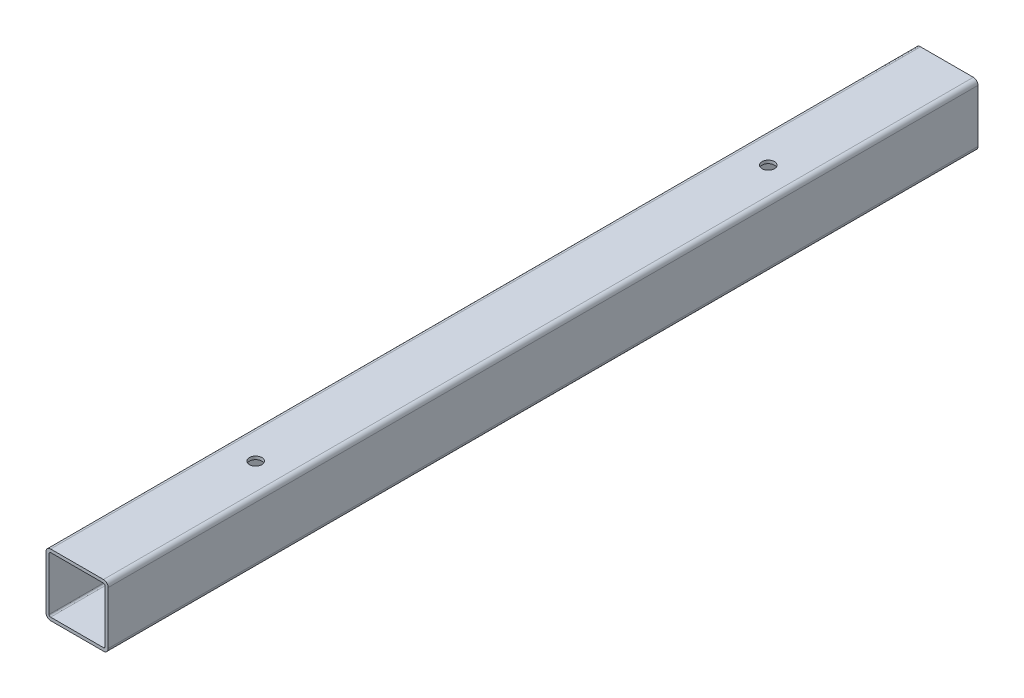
ISO-10303-21;
HEADER;
FILE_DESCRIPTION(('STEP AP214'),'2;1');
FILE_NAME('part.step','',(''),(''),'','','');
FILE_SCHEMA(('AUTOMOTIVE_DESIGN { 1 0 10303 214 1 1 1 1 }'));
ENDSEC;
DATA;
#1=APPLICATION_CONTEXT('core data for automotive mechanical design processes');
#2=APPLICATION_PROTOCOL_DEFINITION('international standard','automotive_design',2000,#1);
#3=PRODUCT_CONTEXT('',#1,'mechanical');
#4=PRODUCT('Part','Part','',(#3));
#5=PRODUCT_RELATED_PRODUCT_CATEGORY('part','',(#4));
#6=PRODUCT_DEFINITION_FORMATION('','',#4);
#7=PRODUCT_DEFINITION_CONTEXT('part definition',#1,'design');
#8=PRODUCT_DEFINITION('design','',#6,#7);
#9=PRODUCT_DEFINITION_SHAPE('','',#8);
#10=(LENGTH_UNIT() NAMED_UNIT(*) SI_UNIT(.MILLI.,.METRE.));
#11=(NAMED_UNIT(*) PLANE_ANGLE_UNIT() SI_UNIT($,.RADIAN.));
#12=(NAMED_UNIT(*) SI_UNIT($,.STERADIAN.) SOLID_ANGLE_UNIT());
#13=UNCERTAINTY_MEASURE_WITH_UNIT(LENGTH_MEASURE(1.E-05),#10,'distance_accuracy_value','');
#14=(GEOMETRIC_REPRESENTATION_CONTEXT(3) GLOBAL_UNCERTAINTY_ASSIGNED_CONTEXT((#13)) GLOBAL_UNIT_ASSIGNED_CONTEXT((#10,
#11,#12)) REPRESENTATION_CONTEXT('',''));
#15=CARTESIAN_POINT('',(0.,0.,0.));
#16=DIRECTION('',(0.,0.,1.));
#17=DIRECTION('',(1.,0.,0.));
#18=AXIS2_PLACEMENT_3D('',#15,#16,#17);
#19=CARTESIAN_POINT('',(3.,37.,560.));
#20=DIRECTION('',(0.,0.,1.));
#21=DIRECTION('',(1.,0.,0.));
#22=AXIS2_PLACEMENT_3D('',#19,#20,#21);
#23=PLANE('',#22);
#24=CARTESIAN_POINT('',(3.,37.,560.));
#25=DIRECTION('',(0.,0.,1.));
#26=DIRECTION('',(1.,0.,0.));
#27=AXIS2_PLACEMENT_3D('',#24,#25,#26);
#28=CIRCLE('',#27,3.);
#29=CARTESIAN_POINT('',(3.00000000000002,40.,560.));
#30=VERTEX_POINT('',#29);
#31=CARTESIAN_POINT('',(0.,37.,560.));
#32=VERTEX_POINT('',#31);
#33=EDGE_CURVE('E224',#30,#32,#28,.T.);
#34=ORIENTED_EDGE('',*,*,#33,.T.);
#35=DIRECTION('',(0.,-1.,0.));
#36=VECTOR('',#35,1.);
#37=CARTESIAN_POINT('',(0.,3.00000000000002,560.));
#38=LINE('',#37,#36);
#39=CARTESIAN_POINT('',(0.,3.00000000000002,560.));
#40=VERTEX_POINT('',#39);
#41=EDGE_CURVE('E227',#32,#40,#38,.T.);
#42=ORIENTED_EDGE('',*,*,#41,.T.);
#43=CARTESIAN_POINT('',(3.,3.,560.));
#44=DIRECTION('',(0.,0.,1.));
#45=DIRECTION('',(1.,0.,0.));
#46=AXIS2_PLACEMENT_3D('',#43,#44,#45);
#47=CIRCLE('',#46,3.);
#48=CARTESIAN_POINT('',(3.00000000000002,0.,560.));
#49=VERTEX_POINT('',#48);
#50=EDGE_CURVE('E229',#40,#49,#47,.T.);
#51=ORIENTED_EDGE('',*,*,#50,.T.);
#52=DIRECTION('',(1.,0.,0.));
#53=VECTOR('',#52,1.);
#54=CARTESIAN_POINT('',(3.00000000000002,0.,560.));
#55=LINE('',#54,#53);
#56=CARTESIAN_POINT('',(37.,0.,560.));
#57=VERTEX_POINT('',#56);
#58=EDGE_CURVE('E231',#49,#57,#55,.T.);
#59=ORIENTED_EDGE('',*,*,#58,.T.);
#60=CARTESIAN_POINT('',(37.,3.,560.));
#61=DIRECTION('',(0.,0.,1.));
#62=DIRECTION('',(1.,0.,0.));
#63=AXIS2_PLACEMENT_3D('',#60,#61,#62);
#64=CIRCLE('',#63,3.);
#65=CARTESIAN_POINT('',(40.,3.00000000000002,560.));
#66=VERTEX_POINT('',#65);
#67=EDGE_CURVE('E233',#57,#66,#64,.T.);
#68=ORIENTED_EDGE('',*,*,#67,.T.);
#69=DIRECTION('',(0.,1.,0.));
#70=VECTOR('',#69,1.);
#71=CARTESIAN_POINT('',(40.,3.00000000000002,560.));
#72=LINE('',#71,#70);
#73=CARTESIAN_POINT('',(40.,37.,560.));
#74=VERTEX_POINT('',#73);
#75=EDGE_CURVE('E235',#66,#74,#72,.T.);
#76=ORIENTED_EDGE('',*,*,#75,.T.);
#77=CARTESIAN_POINT('',(37.,37.,560.));
#78=DIRECTION('',(0.,0.,1.));
#79=DIRECTION('',(1.,0.,0.));
#80=AXIS2_PLACEMENT_3D('',#77,#78,#79);
#81=CIRCLE('',#80,3.);
#82=CARTESIAN_POINT('',(37.,40.,560.));
#83=VERTEX_POINT('',#82);
#84=EDGE_CURVE('E237',#74,#83,#81,.T.);
#85=ORIENTED_EDGE('',*,*,#84,.T.);
#86=DIRECTION('',(-1.,0.,0.));
#87=VECTOR('',#86,1.);
#88=CARTESIAN_POINT('',(3.00000000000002,40.,560.));
#89=LINE('',#88,#87);
#90=EDGE_CURVE('E239',#83,#30,#89,.T.);
#91=ORIENTED_EDGE('',*,*,#90,.T.);
#92=EDGE_LOOP('',(#34,#42,#51,#59,#68,#76,#85,#91));
#93=FACE_BOUND('',#92,.T.);
#94=DIRECTION('',(0.,-1.,0.));
#95=VECTOR('',#94,1.);
#96=CARTESIAN_POINT('',(2.,3.00000000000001,560.));
#97=LINE('',#96,#95);
#98=CARTESIAN_POINT('',(2.,37.,560.));
#99=VERTEX_POINT('',#98);
#100=CARTESIAN_POINT('',(2.,3.00000000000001,560.));
#101=VERTEX_POINT('',#100);
#102=EDGE_CURVE('E182',#99,#101,#97,.T.);
#103=ORIENTED_EDGE('',*,*,#102,.F.);
#104=CARTESIAN_POINT('',(3.,37.,560.));
#105=DIRECTION('',(0.,0.,1.));
#106=DIRECTION('',(1.,0.,0.));
#107=AXIS2_PLACEMENT_3D('',#104,#105,#106);
#108=CIRCLE('',#107,1.);
#109=CARTESIAN_POINT('',(3.00000000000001,38.,560.));
#110=VERTEX_POINT('',#109);
#111=EDGE_CURVE('E154',#110,#99,#108,.T.);
#112=ORIENTED_EDGE('',*,*,#111,.F.);
#113=DIRECTION('',(-1.,0.,0.));
#114=VECTOR('',#113,1.);
#115=CARTESIAN_POINT('',(3.00000000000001,38.,560.));
#116=LINE('',#115,#114);
#117=CARTESIAN_POINT('',(37.,38.,560.));
#118=VERTEX_POINT('',#117);
#119=EDGE_CURVE('E194',#118,#110,#116,.T.);
#120=ORIENTED_EDGE('',*,*,#119,.F.);
#121=CARTESIAN_POINT('',(37.,37.,560.));
#122=DIRECTION('',(0.,0.,1.));
#123=DIRECTION('',(1.,0.,0.));
#124=AXIS2_PLACEMENT_3D('',#121,#122,#123);
#125=CIRCLE('',#124,1.);
#126=CARTESIAN_POINT('',(38.,37.,560.));
#127=VERTEX_POINT('',#126);
#128=EDGE_CURVE('E192',#127,#118,#125,.T.);
#129=ORIENTED_EDGE('',*,*,#128,.F.);
#130=DIRECTION('',(0.,1.,0.));
#131=VECTOR('',#130,1.);
#132=CARTESIAN_POINT('',(38.,3.00000000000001,560.));
#133=LINE('',#132,#131);
#134=CARTESIAN_POINT('',(38.,3.00000000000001,560.));
#135=VERTEX_POINT('',#134);
#136=EDGE_CURVE('E190',#135,#127,#133,.T.);
#137=ORIENTED_EDGE('',*,*,#136,.F.);
#138=CARTESIAN_POINT('',(37.,3.,560.));
#139=DIRECTION('',(0.,0.,1.));
#140=DIRECTION('',(1.,0.,0.));
#141=AXIS2_PLACEMENT_3D('',#138,#139,#140);
#142=CIRCLE('',#141,1.);
#143=CARTESIAN_POINT('',(37.,2.,560.));
#144=VERTEX_POINT('',#143);
#145=EDGE_CURVE('E188',#144,#135,#142,.T.);
#146=ORIENTED_EDGE('',*,*,#145,.F.);
#147=DIRECTION('',(1.,0.,0.));
#148=VECTOR('',#147,1.);
#149=CARTESIAN_POINT('',(3.00000000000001,2.,560.));
#150=LINE('',#149,#148);
#151=CARTESIAN_POINT('',(3.00000000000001,2.,560.));
#152=VERTEX_POINT('',#151);
#153=EDGE_CURVE('E186',#152,#144,#150,.T.);
#154=ORIENTED_EDGE('',*,*,#153,.F.);
#155=CARTESIAN_POINT('',(3.,3.,560.));
#156=DIRECTION('',(0.,0.,1.));
#157=DIRECTION('',(1.,0.,0.));
#158=AXIS2_PLACEMENT_3D('',#155,#156,#157);
#159=CIRCLE('',#158,1.);
#160=EDGE_CURVE('E184',#101,#152,#159,.T.);
#161=ORIENTED_EDGE('',*,*,#160,.F.);
#162=EDGE_LOOP('',(#103,#112,#120,#129,#137,#146,#154,#161));
#163=FACE_BOUND('',#162,.T.);
#164=ADVANCED_FACE('F24',(#93,#163),#23,.T.);
#165=CARTESIAN_POINT('',(3.,37.,0.));
#166=DIRECTION('',(0.,0.,1.));
#167=DIRECTION('',(1.,0.,0.));
#168=AXIS2_PLACEMENT_3D('',#165,#166,#167);
#169=PLANE('',#168);
#170=CARTESIAN_POINT('',(3.,37.,0.));
#171=DIRECTION('',(0.,0.,1.));
#172=DIRECTION('',(1.,0.,0.));
#173=AXIS2_PLACEMENT_3D('',#170,#171,#172);
#174=CIRCLE('',#173,3.);
#175=CARTESIAN_POINT('',(3.00000000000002,40.,0.));
#176=VERTEX_POINT('',#175);
#177=CARTESIAN_POINT('',(0.,37.,0.));
#178=VERTEX_POINT('',#177);
#179=EDGE_CURVE('E155',#176,#178,#174,.T.);
#180=ORIENTED_EDGE('',*,*,#179,.F.);
#181=DIRECTION('',(-1.,0.,0.));
#182=VECTOR('',#181,1.);
#183=CARTESIAN_POINT('',(3.00000000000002,40.,0.));
#184=LINE('',#183,#182);
#185=CARTESIAN_POINT('',(37.,40.,0.));
#186=VERTEX_POINT('',#185);
#187=EDGE_CURVE('E222',#186,#176,#184,.T.);
#188=ORIENTED_EDGE('',*,*,#187,.F.);
#189=CARTESIAN_POINT('',(37.,37.,0.));
#190=DIRECTION('',(0.,0.,1.));
#191=DIRECTION('',(1.,0.,0.));
#192=AXIS2_PLACEMENT_3D('',#189,#190,#191);
#193=CIRCLE('',#192,3.);
#194=CARTESIAN_POINT('',(40.,37.,0.));
#195=VERTEX_POINT('',#194);
#196=EDGE_CURVE('E220',#195,#186,#193,.T.);
#197=ORIENTED_EDGE('',*,*,#196,.F.);
#198=DIRECTION('',(0.,1.,0.));
#199=VECTOR('',#198,1.);
#200=CARTESIAN_POINT('',(40.,3.00000000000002,0.));
#201=LINE('',#200,#199);
#202=CARTESIAN_POINT('',(40.,3.00000000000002,0.));
#203=VERTEX_POINT('',#202);
#204=EDGE_CURVE('E218',#203,#195,#201,.T.);
#205=ORIENTED_EDGE('',*,*,#204,.F.);
#206=CARTESIAN_POINT('',(37.,3.,0.));
#207=DIRECTION('',(0.,0.,1.));
#208=DIRECTION('',(1.,0.,0.));
#209=AXIS2_PLACEMENT_3D('',#206,#207,#208);
#210=CIRCLE('',#209,3.);
#211=CARTESIAN_POINT('',(37.,0.,0.));
#212=VERTEX_POINT('',#211);
#213=EDGE_CURVE('E216',#212,#203,#210,.T.);
#214=ORIENTED_EDGE('',*,*,#213,.F.);
#215=DIRECTION('',(1.,0.,0.));
#216=VECTOR('',#215,1.);
#217=CARTESIAN_POINT('',(3.00000000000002,0.,0.));
#218=LINE('',#217,#216);
#219=CARTESIAN_POINT('',(3.00000000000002,0.,0.));
#220=VERTEX_POINT('',#219);
#221=EDGE_CURVE('E214',#220,#212,#218,.T.);
#222=ORIENTED_EDGE('',*,*,#221,.F.);
#223=CARTESIAN_POINT('',(3.,3.,0.));
#224=DIRECTION('',(0.,0.,1.));
#225=DIRECTION('',(1.,0.,0.));
#226=AXIS2_PLACEMENT_3D('',#223,#224,#225);
#227=CIRCLE('',#226,3.);
#228=CARTESIAN_POINT('',(0.,3.00000000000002,0.));
#229=VERTEX_POINT('',#228);
#230=EDGE_CURVE('E212',#229,#220,#227,.T.);
#231=ORIENTED_EDGE('',*,*,#230,.F.);
#232=DIRECTION('',(0.,-1.,0.));
#233=VECTOR('',#232,1.);
#234=CARTESIAN_POINT('',(0.,3.00000000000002,0.));
#235=LINE('',#234,#233);
#236=EDGE_CURVE('E210',#178,#229,#235,.T.);
#237=ORIENTED_EDGE('',*,*,#236,.F.);
#238=EDGE_LOOP('',(#180,#188,#197,#205,#214,#222,#231,#237));
#239=FACE_BOUND('',#238,.T.);
#240=CARTESIAN_POINT('',(3.,37.,0.));
#241=DIRECTION('',(0.,0.,1.));
#242=DIRECTION('',(1.,0.,0.));
#243=AXIS2_PLACEMENT_3D('',#240,#241,#242);
#244=CIRCLE('',#243,1.);
#245=CARTESIAN_POINT('',(3.00000000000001,38.,0.));
#246=VERTEX_POINT('',#245);
#247=CARTESIAN_POINT('',(2.,37.,0.));
#248=VERTEX_POINT('',#247);
#249=EDGE_CURVE('E49',#246,#248,#244,.T.);
#250=ORIENTED_EDGE('',*,*,#249,.T.);
#251=DIRECTION('',(0.,-1.,0.));
#252=VECTOR('',#251,1.);
#253=CARTESIAN_POINT('',(2.,3.00000000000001,0.));
#254=LINE('',#253,#252);
#255=CARTESIAN_POINT('',(2.,3.00000000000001,0.));
#256=VERTEX_POINT('',#255);
#257=EDGE_CURVE('E141',#248,#256,#254,.T.);
#258=ORIENTED_EDGE('',*,*,#257,.T.);
#259=CARTESIAN_POINT('',(3.,3.,0.));
#260=DIRECTION('',(0.,0.,1.));
#261=DIRECTION('',(1.,0.,0.));
#262=AXIS2_PLACEMENT_3D('',#259,#260,#261);
#263=CIRCLE('',#262,1.);
#264=CARTESIAN_POINT('',(3.00000000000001,2.,0.));
#265=VERTEX_POINT('',#264);
#266=EDGE_CURVE('E150',#256,#265,#263,.T.);
#267=ORIENTED_EDGE('',*,*,#266,.T.);
#268=DIRECTION('',(1.,0.,0.));
#269=VECTOR('',#268,1.);
#270=CARTESIAN_POINT('',(3.00000000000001,2.,0.));
#271=LINE('',#270,#269);
#272=CARTESIAN_POINT('',(37.,2.,0.));
#273=VERTEX_POINT('',#272);
#274=EDGE_CURVE('E169',#265,#273,#271,.T.);
#275=ORIENTED_EDGE('',*,*,#274,.T.);
#276=CARTESIAN_POINT('',(37.,3.,0.));
#277=DIRECTION('',(0.,0.,1.));
#278=DIRECTION('',(1.,0.,0.));
#279=AXIS2_PLACEMENT_3D('',#276,#277,#278);
#280=CIRCLE('',#279,1.);
#281=CARTESIAN_POINT('',(38.,3.00000000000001,0.));
#282=VERTEX_POINT('',#281);
#283=EDGE_CURVE('E172',#273,#282,#280,.T.);
#284=ORIENTED_EDGE('',*,*,#283,.T.);
#285=DIRECTION('',(0.,1.,0.));
#286=VECTOR('',#285,1.);
#287=CARTESIAN_POINT('',(38.,3.00000000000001,0.));
#288=LINE('',#287,#286);
#289=CARTESIAN_POINT('',(38.,37.,0.));
#290=VERTEX_POINT('',#289);
#291=EDGE_CURVE('E175',#282,#290,#288,.T.);
#292=ORIENTED_EDGE('',*,*,#291,.T.);
#293=CARTESIAN_POINT('',(37.,37.,0.));
#294=DIRECTION('',(0.,0.,1.));
#295=DIRECTION('',(1.,0.,0.));
#296=AXIS2_PLACEMENT_3D('',#293,#294,#295);
#297=CIRCLE('',#296,1.);
#298=CARTESIAN_POINT('',(37.,38.,0.));
#299=VERTEX_POINT('',#298);
#300=EDGE_CURVE('E178',#290,#299,#297,.T.);
#301=ORIENTED_EDGE('',*,*,#300,.T.);
#302=DIRECTION('',(-1.,0.,0.));
#303=VECTOR('',#302,1.);
#304=CARTESIAN_POINT('',(3.00000000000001,38.,0.));
#305=LINE('',#304,#303);
#306=EDGE_CURVE('E160',#299,#246,#305,.T.);
#307=ORIENTED_EDGE('',*,*,#306,.T.);
#308=EDGE_LOOP('',(#250,#258,#267,#275,#284,#292,#301,#307));
#309=FACE_BOUND('',#308,.T.);
#310=ADVANCED_FACE('F158',(#239,#309),#169,.F.);
#311=CARTESIAN_POINT('',(3.,37.,560.));
#312=DIRECTION('',(0.,0.,-1.));
#313=DIRECTION('',(-1.,0.,0.));
#314=AXIS2_PLACEMENT_3D('',#311,#312,#313);
#315=CYLINDRICAL_SURFACE('',#314,3.);
#316=ORIENTED_EDGE('',*,*,#179,.T.);
#317=DIRECTION('',(0.,0.,-1.));
#318=VECTOR('',#317,1.);
#319=CARTESIAN_POINT('',(0.,37.,560.));
#320=LINE('',#319,#318);
#321=EDGE_CURVE('E11',#32,#178,#320,.T.);
#322=ORIENTED_EDGE('',*,*,#321,.F.);
#323=ORIENTED_EDGE('',*,*,#33,.F.);
#324=DIRECTION('',(0.,0.,-1.));
#325=VECTOR('',#324,1.);
#326=CARTESIAN_POINT('',(3.00000000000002,40.,560.));
#327=LINE('',#326,#325);
#328=EDGE_CURVE('E241',#30,#176,#327,.T.);
#329=ORIENTED_EDGE('',*,*,#328,.T.);
#330=EDGE_LOOP('',(#316,#322,#323,#329));
#331=FACE_BOUND('',#330,.T.);
#332=ADVANCED_FACE('F26',(#331),#315,.T.);
#333=CARTESIAN_POINT('',(0.,3.00000000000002,560.));
#334=DIRECTION('',(1.,0.,0.));
#335=DIRECTION('',(0.,0.,-1.));
#336=AXIS2_PLACEMENT_3D('',#333,#334,#335);
#337=PLANE('',#336);
#338=ORIENTED_EDGE('',*,*,#236,.T.);
#339=DIRECTION('',(0.,0.,-1.));
#340=VECTOR('',#339,1.);
#341=CARTESIAN_POINT('',(0.,3.00000000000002,560.));
#342=LINE('',#341,#340);
#343=EDGE_CURVE('E33',#40,#229,#342,.T.);
#344=ORIENTED_EDGE('',*,*,#343,.F.);
#345=ORIENTED_EDGE('',*,*,#41,.F.);
#346=ORIENTED_EDGE('',*,*,#321,.T.);
#347=EDGE_LOOP('',(#338,#344,#345,#346));
#348=FACE_BOUND('',#347,.T.);
#349=ADVANCED_FACE('F304',(#348),#337,.F.);
#350=CARTESIAN_POINT('',(3.,3.,560.));
#351=DIRECTION('',(0.,0.,-1.));
#352=DIRECTION('',(-1.,0.,0.));
#353=AXIS2_PLACEMENT_3D('',#350,#351,#352);
#354=CYLINDRICAL_SURFACE('',#353,3.);
#355=ORIENTED_EDGE('',*,*,#230,.T.);
#356=DIRECTION('',(0.,0.,-1.));
#357=VECTOR('',#356,1.);
#358=CARTESIAN_POINT('',(3.00000000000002,0.,560.));
#359=LINE('',#358,#357);
#360=EDGE_CURVE('E256',#49,#220,#359,.T.);
#361=ORIENTED_EDGE('',*,*,#360,.F.);
#362=ORIENTED_EDGE('',*,*,#50,.F.);
#363=ORIENTED_EDGE('',*,*,#343,.T.);
#364=EDGE_LOOP('',(#355,#361,#362,#363));
#365=FACE_BOUND('',#364,.T.);
#366=ADVANCED_FACE('F326',(#365),#354,.T.);
#367=CARTESIAN_POINT('',(3.00000000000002,0.,560.));
#368=DIRECTION('',(0.,1.,0.));
#369=DIRECTION('',(0.,0.,1.));
#370=AXIS2_PLACEMENT_3D('',#367,#368,#369);
#371=PLANE('',#370);
#372=CARTESIAN_POINT('',(20.,0.,445.));
#373=DIRECTION('',(0.,1.,0.));
#374=DIRECTION('',(0.,0.,1.));
#375=AXIS2_PLACEMENT_3D('',#372,#373,#374);
#376=CIRCLE('',#375,4.);
#377=CARTESIAN_POINT('',(20.,0.,449.));
#378=VERTEX_POINT('',#377);
#379=EDGE_CURVE('E274',#378,#378,#376,.T.);
#380=ORIENTED_EDGE('',*,*,#379,.T.);
#381=EDGE_LOOP('',(#380));
#382=FACE_BOUND('',#381,.T.);
#383=CARTESIAN_POINT('',(20.,0.,115.));
#384=DIRECTION('',(0.,1.,0.));
#385=DIRECTION('',(0.,0.,1.));
#386=AXIS2_PLACEMENT_3D('',#383,#384,#385);
#387=CIRCLE('',#386,4.);
#388=CARTESIAN_POINT('',(20.,0.,119.));
#389=VERTEX_POINT('',#388);
#390=EDGE_CURVE('E261',#389,#389,#387,.T.);
#391=ORIENTED_EDGE('',*,*,#390,.T.);
#392=EDGE_LOOP('',(#391));
#393=FACE_BOUND('',#392,.T.);
#394=ORIENTED_EDGE('',*,*,#221,.T.);
#395=DIRECTION('',(0.,0.,-1.));
#396=VECTOR('',#395,1.);
#397=CARTESIAN_POINT('',(37.,0.,560.));
#398=LINE('',#397,#396);
#399=EDGE_CURVE('E253',#57,#212,#398,.T.);
#400=ORIENTED_EDGE('',*,*,#399,.F.);
#401=ORIENTED_EDGE('',*,*,#58,.F.);
#402=ORIENTED_EDGE('',*,*,#360,.T.);
#403=EDGE_LOOP('',(#394,#400,#401,#402));
#404=FACE_BOUND('',#403,.T.);
#405=ADVANCED_FACE('F323',(#382,#393,#404),#371,.F.);
#406=CARTESIAN_POINT('',(37.,3.,560.));
#407=DIRECTION('',(0.,0.,-1.));
#408=DIRECTION('',(-1.,0.,0.));
#409=AXIS2_PLACEMENT_3D('',#406,#407,#408);
#410=CYLINDRICAL_SURFACE('',#409,3.);
#411=ORIENTED_EDGE('',*,*,#213,.T.);
#412=DIRECTION('',(0.,0.,-1.));
#413=VECTOR('',#412,1.);
#414=CARTESIAN_POINT('',(40.,3.00000000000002,560.));
#415=LINE('',#414,#413);
#416=EDGE_CURVE('E250',#66,#203,#415,.T.);
#417=ORIENTED_EDGE('',*,*,#416,.F.);
#418=ORIENTED_EDGE('',*,*,#67,.F.);
#419=ORIENTED_EDGE('',*,*,#399,.T.);
#420=EDGE_LOOP('',(#411,#417,#418,#419));
#421=FACE_BOUND('',#420,.T.);
#422=ADVANCED_FACE('F319',(#421),#410,.T.);
#423=CARTESIAN_POINT('',(40.,3.00000000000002,560.));
#424=DIRECTION('',(-1.,0.,0.));
#425=DIRECTION('',(0.,0.,1.));
#426=AXIS2_PLACEMENT_3D('',#423,#424,#425);
#427=PLANE('',#426);
#428=ORIENTED_EDGE('',*,*,#204,.T.);
#429=DIRECTION('',(0.,0.,-1.));
#430=VECTOR('',#429,1.);
#431=CARTESIAN_POINT('',(40.,37.,560.));
#432=LINE('',#431,#430);
#433=EDGE_CURVE('E247',#74,#195,#432,.T.);
#434=ORIENTED_EDGE('',*,*,#433,.F.);
#435=ORIENTED_EDGE('',*,*,#75,.F.);
#436=ORIENTED_EDGE('',*,*,#416,.T.);
#437=EDGE_LOOP('',(#428,#434,#435,#436));
#438=FACE_BOUND('',#437,.T.);
#439=ADVANCED_FACE('F315',(#438),#427,.F.);
#440=CARTESIAN_POINT('',(37.,37.,560.));
#441=DIRECTION('',(0.,0.,-1.));
#442=DIRECTION('',(-1.,0.,0.));
#443=AXIS2_PLACEMENT_3D('',#440,#441,#442);
#444=CYLINDRICAL_SURFACE('',#443,3.);
#445=ORIENTED_EDGE('',*,*,#196,.T.);
#446=DIRECTION('',(0.,0.,-1.));
#447=VECTOR('',#446,1.);
#448=CARTESIAN_POINT('',(37.,40.,560.));
#449=LINE('',#448,#447);
#450=EDGE_CURVE('E244',#83,#186,#449,.T.);
#451=ORIENTED_EDGE('',*,*,#450,.F.);
#452=ORIENTED_EDGE('',*,*,#84,.F.);
#453=ORIENTED_EDGE('',*,*,#433,.T.);
#454=EDGE_LOOP('',(#445,#451,#452,#453));
#455=FACE_BOUND('',#454,.T.);
#456=ADVANCED_FACE('F286',(#455),#444,.T.);
#457=CARTESIAN_POINT('',(3.00000000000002,40.,560.));
#458=DIRECTION('',(0.,-1.,0.));
#459=DIRECTION('',(0.,0.,-1.));
#460=AXIS2_PLACEMENT_3D('',#457,#458,#459);
#461=PLANE('',#460);
#462=CARTESIAN_POINT('',(20.,40.,445.));
#463=DIRECTION('',(0.,1.,0.));
#464=DIRECTION('',(0.,0.,1.));
#465=AXIS2_PLACEMENT_3D('',#462,#463,#464);
#466=CIRCLE('',#465,4.);
#467=CARTESIAN_POINT('',(20.,40.,449.));
#468=VERTEX_POINT('',#467);
#469=EDGE_CURVE('E277',#468,#468,#466,.T.);
#470=ORIENTED_EDGE('',*,*,#469,.F.);
#471=EDGE_LOOP('',(#470));
#472=FACE_BOUND('',#471,.T.);
#473=CARTESIAN_POINT('',(20.,40.,115.));
#474=DIRECTION('',(0.,1.,0.));
#475=DIRECTION('',(0.,0.,1.));
#476=AXIS2_PLACEMENT_3D('',#473,#474,#475);
#477=CIRCLE('',#476,4.);
#478=CARTESIAN_POINT('',(20.,40.,119.));
#479=VERTEX_POINT('',#478);
#480=EDGE_CURVE('E265',#479,#479,#477,.T.);
#481=ORIENTED_EDGE('',*,*,#480,.F.);
#482=EDGE_LOOP('',(#481));
#483=FACE_BOUND('',#482,.T.);
#484=ORIENTED_EDGE('',*,*,#187,.T.);
#485=ORIENTED_EDGE('',*,*,#328,.F.);
#486=ORIENTED_EDGE('',*,*,#90,.F.);
#487=ORIENTED_EDGE('',*,*,#450,.T.);
#488=EDGE_LOOP('',(#484,#485,#486,#487));
#489=FACE_BOUND('',#488,.T.);
#490=ADVANCED_FACE('F283',(#472,#483,#489),#461,.F.);
#491=CARTESIAN_POINT('',(3.,37.,560.));
#492=DIRECTION('',(0.,0.,-1.));
#493=DIRECTION('',(-1.,0.,0.));
#494=AXIS2_PLACEMENT_3D('',#491,#492,#493);
#495=CYLINDRICAL_SURFACE('',#494,1.);
#496=ORIENTED_EDGE('',*,*,#249,.F.);
#497=DIRECTION('',(0.,0.,-1.));
#498=VECTOR('',#497,1.);
#499=CARTESIAN_POINT('',(3.00000000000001,38.,560.));
#500=LINE('',#499,#498);
#501=EDGE_CURVE('E196',#110,#246,#500,.T.);
#502=ORIENTED_EDGE('',*,*,#501,.F.);
#503=ORIENTED_EDGE('',*,*,#111,.T.);
#504=DIRECTION('',(0.,0.,-1.));
#505=VECTOR('',#504,1.);
#506=CARTESIAN_POINT('',(2.,37.,560.));
#507=LINE('',#506,#505);
#508=EDGE_CURVE('E143',#99,#248,#507,.T.);
#509=ORIENTED_EDGE('',*,*,#508,.T.);
#510=EDGE_LOOP('',(#496,#502,#503,#509));
#511=FACE_BOUND('',#510,.T.);
#512=ADVANCED_FACE('F152',(#511),#495,.F.);
#513=CARTESIAN_POINT('',(2.,3.00000000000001,560.));
#514=DIRECTION('',(1.,0.,0.));
#515=DIRECTION('',(0.,0.,-1.));
#516=AXIS2_PLACEMENT_3D('',#513,#514,#515);
#517=PLANE('',#516);
#518=ORIENTED_EDGE('',*,*,#257,.F.);
#519=ORIENTED_EDGE('',*,*,#508,.F.);
#520=ORIENTED_EDGE('',*,*,#102,.T.);
#521=DIRECTION('',(0.,0.,-1.));
#522=VECTOR('',#521,1.);
#523=CARTESIAN_POINT('',(2.,3.00000000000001,560.));
#524=LINE('',#523,#522);
#525=EDGE_CURVE('E146',#101,#256,#524,.T.);
#526=ORIENTED_EDGE('',*,*,#525,.T.);
#527=EDGE_LOOP('',(#518,#519,#520,#526));
#528=FACE_BOUND('',#527,.T.);
#529=ADVANCED_FACE('F142',(#528),#517,.T.);
#530=CARTESIAN_POINT('',(3.,3.,560.));
#531=DIRECTION('',(0.,0.,-1.));
#532=DIRECTION('',(-1.,0.,0.));
#533=AXIS2_PLACEMENT_3D('',#530,#531,#532);
#534=CYLINDRICAL_SURFACE('',#533,1.);
#535=ORIENTED_EDGE('',*,*,#266,.F.);
#536=ORIENTED_EDGE('',*,*,#525,.F.);
#537=ORIENTED_EDGE('',*,*,#160,.T.);
#538=DIRECTION('',(0.,0.,-1.));
#539=VECTOR('',#538,1.);
#540=CARTESIAN_POINT('',(3.00000000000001,2.,560.));
#541=LINE('',#540,#539);
#542=EDGE_CURVE('E205',#152,#265,#541,.T.);
#543=ORIENTED_EDGE('',*,*,#542,.T.);
#544=EDGE_LOOP('',(#535,#536,#537,#543));
#545=FACE_BOUND('',#544,.T.);
#546=ADVANCED_FACE('F371',(#545),#534,.F.);
#547=CARTESIAN_POINT('',(3.00000000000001,2.,560.));
#548=DIRECTION('',(0.,1.,0.));
#549=DIRECTION('',(0.,0.,1.));
#550=AXIS2_PLACEMENT_3D('',#547,#548,#549);
#551=PLANE('',#550);
#552=CARTESIAN_POINT('',(20.,2.,445.));
#553=DIRECTION('',(0.,1.,0.));
#554=DIRECTION('',(0.,0.,1.));
#555=AXIS2_PLACEMENT_3D('',#552,#553,#554);
#556=CIRCLE('',#555,4.);
#557=CARTESIAN_POINT('',(20.,2.,449.));
#558=VERTEX_POINT('',#557);
#559=EDGE_CURVE('E269',#558,#558,#556,.T.);
#560=ORIENTED_EDGE('',*,*,#559,.F.);
#561=EDGE_LOOP('',(#560));
#562=FACE_BOUND('',#561,.T.);
#563=CARTESIAN_POINT('',(20.,2.,115.));
#564=DIRECTION('',(0.,1.,0.));
#565=DIRECTION('',(0.,0.,1.));
#566=AXIS2_PLACEMENT_3D('',#563,#564,#565);
#567=CIRCLE('',#566,4.);
#568=CARTESIAN_POINT('',(20.,2.,119.));
#569=VERTEX_POINT('',#568);
#570=EDGE_CURVE('E161',#569,#569,#567,.T.);
#571=ORIENTED_EDGE('',*,*,#570,.F.);
#572=EDGE_LOOP('',(#571));
#573=FACE_BOUND('',#572,.T.);
#574=ORIENTED_EDGE('',*,*,#274,.F.);
#575=ORIENTED_EDGE('',*,*,#542,.F.);
#576=ORIENTED_EDGE('',*,*,#153,.T.);
#577=DIRECTION('',(0.,0.,-1.));
#578=VECTOR('',#577,1.);
#579=CARTESIAN_POINT('',(37.,2.,560.));
#580=LINE('',#579,#578);
#581=EDGE_CURVE('E203',#144,#273,#580,.T.);
#582=ORIENTED_EDGE('',*,*,#581,.T.);
#583=EDGE_LOOP('',(#574,#575,#576,#582));
#584=FACE_BOUND('',#583,.T.);
#585=ADVANCED_FACE('F378',(#562,#573,#584),#551,.T.);
#586=CARTESIAN_POINT('',(37.,3.,560.));
#587=DIRECTION('',(0.,0.,-1.));
#588=DIRECTION('',(-1.,0.,0.));
#589=AXIS2_PLACEMENT_3D('',#586,#587,#588);
#590=CYLINDRICAL_SURFACE('',#589,1.);
#591=ORIENTED_EDGE('',*,*,#283,.F.);
#592=ORIENTED_EDGE('',*,*,#581,.F.);
#593=ORIENTED_EDGE('',*,*,#145,.T.);
#594=DIRECTION('',(0.,0.,-1.));
#595=VECTOR('',#594,1.);
#596=CARTESIAN_POINT('',(38.,3.00000000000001,560.));
#597=LINE('',#596,#595);
#598=EDGE_CURVE('E201',#135,#282,#597,.T.);
#599=ORIENTED_EDGE('',*,*,#598,.T.);
#600=EDGE_LOOP('',(#591,#592,#593,#599));
#601=FACE_BOUND('',#600,.T.);
#602=ADVANCED_FACE('F384',(#601),#590,.F.);
#603=CARTESIAN_POINT('',(38.,3.00000000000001,560.));
#604=DIRECTION('',(-1.,0.,0.));
#605=DIRECTION('',(0.,0.,1.));
#606=AXIS2_PLACEMENT_3D('',#603,#604,#605);
#607=PLANE('',#606);
#608=ORIENTED_EDGE('',*,*,#291,.F.);
#609=ORIENTED_EDGE('',*,*,#598,.F.);
#610=ORIENTED_EDGE('',*,*,#136,.T.);
#611=DIRECTION('',(0.,0.,-1.));
#612=VECTOR('',#611,1.);
#613=CARTESIAN_POINT('',(38.,37.,560.));
#614=LINE('',#613,#612);
#615=EDGE_CURVE('E199',#127,#290,#614,.T.);
#616=ORIENTED_EDGE('',*,*,#615,.T.);
#617=EDGE_LOOP('',(#608,#609,#610,#616));
#618=FACE_BOUND('',#617,.T.);
#619=ADVANCED_FACE('F388',(#618),#607,.T.);
#620=CARTESIAN_POINT('',(37.,37.,560.));
#621=DIRECTION('',(0.,0.,-1.));
#622=DIRECTION('',(-1.,0.,0.));
#623=AXIS2_PLACEMENT_3D('',#620,#621,#622);
#624=CYLINDRICAL_SURFACE('',#623,1.);
#625=ORIENTED_EDGE('',*,*,#300,.F.);
#626=ORIENTED_EDGE('',*,*,#615,.F.);
#627=ORIENTED_EDGE('',*,*,#128,.T.);
#628=DIRECTION('',(0.,0.,-1.));
#629=VECTOR('',#628,1.);
#630=CARTESIAN_POINT('',(37.,38.,560.));
#631=LINE('',#630,#629);
#632=EDGE_CURVE('E41',#118,#299,#631,.T.);
#633=ORIENTED_EDGE('',*,*,#632,.T.);
#634=EDGE_LOOP('',(#625,#626,#627,#633));
#635=FACE_BOUND('',#634,.T.);
#636=ADVANCED_FACE('F396',(#635),#624,.F.);
#637=CARTESIAN_POINT('',(3.00000000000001,38.,560.));
#638=DIRECTION('',(0.,-1.,0.));
#639=DIRECTION('',(0.,0.,-1.));
#640=AXIS2_PLACEMENT_3D('',#637,#638,#639);
#641=PLANE('',#640);
#642=CARTESIAN_POINT('',(20.,38.,445.));
#643=DIRECTION('',(0.,-1.,0.));
#644=DIRECTION('',(0.,0.,-1.));
#645=AXIS2_PLACEMENT_3D('',#642,#643,#644);
#646=CIRCLE('',#645,4.);
#647=CARTESIAN_POINT('',(20.,38.,441.));
#648=VERTEX_POINT('',#647);
#649=EDGE_CURVE('E28',#648,#648,#646,.T.);
#650=ORIENTED_EDGE('',*,*,#649,.F.);
#651=EDGE_LOOP('',(#650));
#652=FACE_BOUND('',#651,.T.);
#653=CARTESIAN_POINT('',(20.,38.,115.));
#654=DIRECTION('',(0.,-1.,0.));
#655=DIRECTION('',(0.,0.,-1.));
#656=AXIS2_PLACEMENT_3D('',#653,#654,#655);
#657=CIRCLE('',#656,4.);
#658=CARTESIAN_POINT('',(20.,38.,111.));
#659=VERTEX_POINT('',#658);
#660=EDGE_CURVE('E164',#659,#659,#657,.T.);
#661=ORIENTED_EDGE('',*,*,#660,.F.);
#662=EDGE_LOOP('',(#661));
#663=FACE_BOUND('',#662,.T.);
#664=ORIENTED_EDGE('',*,*,#306,.F.);
#665=ORIENTED_EDGE('',*,*,#632,.F.);
#666=ORIENTED_EDGE('',*,*,#119,.T.);
#667=ORIENTED_EDGE('',*,*,#501,.T.);
#668=EDGE_LOOP('',(#664,#665,#666,#667));
#669=FACE_BOUND('',#668,.T.);
#670=ADVANCED_FACE('F403',(#652,#663,#669),#641,.T.);
#671=CARTESIAN_POINT('',(20.,0.,115.));
#672=DIRECTION('',(0.,1.,0.));
#673=DIRECTION('',(0.,0.,1.));
#674=AXIS2_PLACEMENT_3D('',#671,#672,#673);
#675=CYLINDRICAL_SURFACE('',#674,4.);
#676=ORIENTED_EDGE('',*,*,#660,.T.);
#677=EDGE_LOOP('',(#676));
#678=FACE_BOUND('',#677,.T.);
#679=ORIENTED_EDGE('',*,*,#480,.T.);
#680=EDGE_LOOP('',(#679));
#681=FACE_BOUND('',#680,.T.);
#682=ADVANCED_FACE('F424',(#678,#681),#675,.F.);
#683=ORIENTED_EDGE('',*,*,#570,.T.);
#684=EDGE_LOOP('',(#683));
#685=FACE_BOUND('',#684,.T.);
#686=ORIENTED_EDGE('',*,*,#390,.F.);
#687=EDGE_LOOP('',(#686));
#688=FACE_BOUND('',#687,.T.);
#689=ADVANCED_FACE('F432',(#685,#688),#675,.F.);
#690=CARTESIAN_POINT('',(20.,0.,445.));
#691=DIRECTION('',(0.,1.,0.));
#692=DIRECTION('',(0.,0.,1.));
#693=AXIS2_PLACEMENT_3D('',#690,#691,#692);
#694=CYLINDRICAL_SURFACE('',#693,4.);
#695=ORIENTED_EDGE('',*,*,#649,.T.);
#696=EDGE_LOOP('',(#695));
#697=FACE_BOUND('',#696,.T.);
#698=ORIENTED_EDGE('',*,*,#469,.T.);
#699=EDGE_LOOP('',(#698));
#700=FACE_BOUND('',#699,.T.);
#701=ADVANCED_FACE('F281',(#697,#700),#694,.F.);
#702=ORIENTED_EDGE('',*,*,#559,.T.);
#703=EDGE_LOOP('',(#702));
#704=FACE_BOUND('',#703,.T.);
#705=ORIENTED_EDGE('',*,*,#379,.F.);
#706=EDGE_LOOP('',(#705));
#707=FACE_BOUND('',#706,.T.);
#708=ADVANCED_FACE('F445',(#704,#707),#694,.F.);
#709=CLOSED_SHELL('',(#164,#310,#332,#349,#366,#405,#422,#439,#456,#490,#512,#529,#546,#585,
#602,#619,#636,#670,#682,#689,#701,#708));
#710=MANIFOLD_SOLID_BREP('B2',#709);
#711=ADVANCED_BREP_SHAPE_REPRESENTATION('',(#18,#710),#14);
#712=SHAPE_DEFINITION_REPRESENTATION(#9,#711);
ENDSEC;
END-ISO-10303-21;
